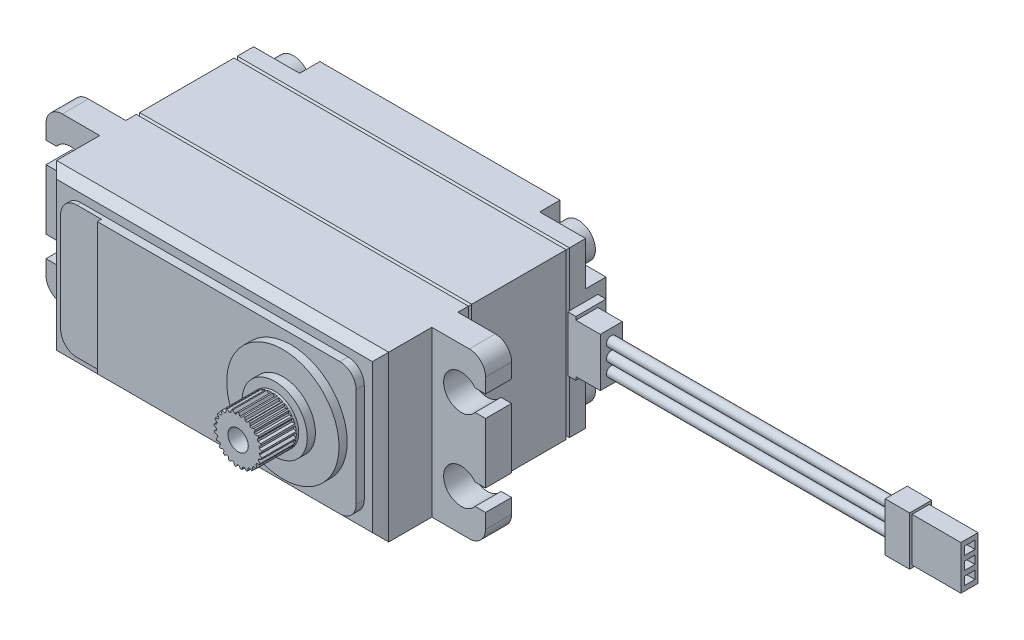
from build123d import *

# Parameters (mm, degrees)
SKETCH_1_W          = 40.8
SKETCH_1_H          = 20.2
EXTRUDE_1_DEPTH     = 4.7
CHAMFER_1_SIZE      = 0.2
SKETCH_2_W          = 40.8
SKETCH_2_H          = 20.2
EXTRUDE_2_DEPTH     = 12
CHAMFER_5_SIZE      = 0.2
SKETCH_3_W          = 40.8
SKETCH_3_H          = 20.2
EXTRUDE_3_DEPTH     = 11
CHAMFER_6_SIZE      = 0.2
CHAMFER_3_SIZE      = 1
CHAMFER_4_SIZE      = 0.2
SKETCH_4_R          = 6.9
EXTRUDE_4_DEPTH     = 2
SKETCH_5_R          = 4
EXTRUDE_5_DEPTH     = 1
SKETCH_6_R          = 2.95
EXTRUDE_6_DEPTH     = 4.5
SKETCH_7_R          = 1.25
CUT_EXTRUDE_1_DEPTH = 5
CUT_EXTRUDE_2_DEPTH = 4.2
EXTRUDE_7_DEPTH     = 3.2
FILLET_1_R          = 2
SKETCH_10_W         = 36.8
SKETCH_10_H         = 16.2
SKETCH_10_R         = 6.9
EXTRUDE_8_DEPTH     = 1
SKETCH_11_W         = 5
SKETCH_11_H         = 16.2
CUT_EXTRUDE_3_DEPTH = 0.5
FILLET_2_R          = 2
SKETCH_12_W         = 3.7
SKETCH_12_H         = 6.8
EXTRUDE_9_DEPTH     = 1
SKETCH_13_W         = 2.7
SKETCH_13_H         = 6
EXTRUDE_10_DEPTH    = 3
SKETCH_14_R         = 0.6
EXTRUDE_11_DEPTH    = 35
SKETCH_15_W         = 2.7
SKETCH_15_H         = 6
EXTRUDE_12_DEPTH    = 3
SKETCH_16_W         = 2.1
SKETCH_16_H         = 5.4
SKETCH_16_W_2       = 1.300246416
SKETCH_16_H_2       = 1
EXTRUDE_13_DEPTH    = 6
SKETCH_17_R         = 1
CUT_EXTRUDE_4_DEPTH = 2.5
SKETCH_18_R         = 1
CUT_EXTRUDE_5_DEPTH = 2.5
SKETCH_19_R         = 2.1
EXTRUDE_14_DEPTH    = 2


with BuildPart() as part:
    # Sketch 1 → Extrude 1 (new body)
    with BuildSketch(Plane.XY):
        Rectangle(SKETCH_1_W, SKETCH_1_H)
    extrude(amount=EXTRUDE_1_DEPTH)

    # Chamfer 1
    chamfer_1_edges = [part.edges().sort_by_distance(p)[0] for p in [
        (20.4, 0, 4.7),
        (0, 10.1, 4.7),
        (-20.4, 0, 4.7),
        (0, -10.1, 4.7),
    ]]
    chamfer(chamfer_1_edges, length=CHAMFER_1_SIZE)



with BuildPart() as body_2:
    # Sketch 2 → Extrude 2 (new body)
    with BuildSketch(Plane.XY.offset(4.7)):
        Rectangle(SKETCH_2_W, SKETCH_2_H)
    extrude(amount=EXTRUDE_2_DEPTH)

    # Chamfer 5
    chamfer_5_edges = [body_2.edges().sort_by_distance(p)[0] for p in [
        (0, -10.1, 16.7),
        (20.4, 0, 16.7),
        (0, 10.1, 16.7),
        (-20.4, 0, 16.7),
    ]]
    chamfer(chamfer_5_edges, length=CHAMFER_5_SIZE)

    # Chamfer 4
    chamfer_4_edges = [body_2.edges().sort_by_distance(p)[0] for p in [
        (20.4, 0, 4.7),
        (0, -10.1, 4.7),
        (-20.4, 0, 4.7),
        (0, 10.1, 4.7),
    ]]
    chamfer(chamfer_4_edges, length=CHAMFER_4_SIZE)


with BuildPart() as body_3:
    # Sketch 3 → Extrude 3 (new body)
    with BuildSketch(Plane.XY.offset(16.7)):
        Rectangle(SKETCH_3_W, SKETCH_3_H)
    extrude(amount=EXTRUDE_3_DEPTH)

    # Chamfer 6
    chamfer_6_edges = [body_3.edges().sort_by_distance(p)[0] for p in [
        (20.4, 0, 16.7),
        (0, -10.1, 16.7),
        (-20.4, 0, 16.7),
        (0, 10.1, 16.7),
    ]]
    chamfer(chamfer_6_edges, length=CHAMFER_6_SIZE)

    # Chamfer 3
    chamfer_3_edges = [body_3.edges().sort_by_distance(p)[0] for p in [
        (0, -10.1, 27.7),
        (20.4, 0, 27.7),
        (0, 10.1, 27.7),
        (-20.4, 0, 27.7),
    ]]
    chamfer(chamfer_3_edges, length=CHAMFER_3_SIZE)

    # Sketch 4 → Extrude 4 (add)
    with BuildSketch(Plane.XY.offset(27.7)):
        with Locations(Location((10.4, 0, 0), (0, 0, 180))):
            Circle(SKETCH_4_R)
    extrude(amount=EXTRUDE_4_DEPTH)

    # Sketch 5 → Extrude 5 (add)
    with BuildSketch(Plane.XY.offset(29.7)):
        with Locations((10.4, 0)):
            Circle(SKETCH_5_R)
    extrude(amount=EXTRUDE_5_DEPTH)

    # Sketch 6 → Extrude 6 (add)
    with BuildSketch(Plane.XY.offset(30.7)):
        with Locations((10.4, 0)):
            Circle(SKETCH_6_R)
    extrude(amount=EXTRUDE_6_DEPTH)

    # Sketch 7 → Cut-Extrude 1 (cut)
    with BuildSketch(Plane.XY.offset(35.2)):
        with Locations((10.4, 0)):
            Circle(SKETCH_7_R)
    extrude(amount=-CUT_EXTRUDE_1_DEPTH, mode=Mode.SUBTRACT)

    # Sketch 8 → Cut-Extrude 2 (cut)
    with BuildSketch(Plane.XY.offset(35.2)):
        with BuildLine():
            Line((11.036355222, 2.880547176), (10.812882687, 2.613339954))
            ThreePointArc((10.812882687, 2.613339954), (10.718629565, 2.62690868), (10.623963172, 2.637206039))
            Line((10.623963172, 2.637206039), (10.475180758, 2.949041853))
            ThreePointArc((10.475180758, 2.949041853), (10.757412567, 2.928268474), (11.036355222, 2.880547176))
        make_face()
        with BuildLine():
            Line((10.3, 2.948304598), (10.15, 2.633916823))
            ThreePointArc((10.15, 2.633916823), (10.055333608, 2.623619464), (9.961080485, 2.610050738))
            Line((9.961080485, 2.610050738), (9.739421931, 2.875088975))
            ThreePointArc((9.739421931, 2.875088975), (10.017953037, 2.925156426), (10.3, 2.948304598))
        make_face()
        with BuildLine():
            Line((11.732725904, 2.631794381), (11.449822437, 2.428557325))
            ThreePointArc((11.449822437, 2.428557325), (11.361904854, 2.465139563), (11.27277343, 2.498655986))
            Line((11.27277343, 2.498655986), (11.206215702, 2.837695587))
            ThreePointArc((11.206215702, 2.837695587), (11.47441455, 2.747386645), (11.732725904, 2.631794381))
        make_face()
        with BuildLine():
            Line((12.345356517, 2.217676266), (12.020797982, 2.091179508))
            ThreePointArc((12.020797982, 2.091179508), (11.944740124, 2.148476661), (11.866744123, 2.203106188))
            Line((11.866744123, 2.203106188), (11.886593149, 2.54804647))
            ThreePointArc((11.886593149, 2.54804647), (12.123907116, 2.393876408), (12.345356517, 2.217676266))
        make_face()
        with BuildLine():
            Line((12.835753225, 1.664213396), (12.489932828, 1.622405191))
            ThreePointArc((12.489932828, 1.622405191), (12.430513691, 1.696817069), (12.368553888, 1.769127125))
            Line((12.368553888, 1.769127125), (12.47356248, 2.098294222))
            ThreePointArc((12.47356248, 2.098294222), (12.665080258, 1.889950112), (12.835753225, 1.664213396))
        make_face()
        with BuildLine():
            Line((13.1731026, 1.006181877), (12.827749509, 1.051689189))
            ThreePointArc((12.827749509, 1.051689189), (12.788702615, 1.13854022), (12.746672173, 1.223987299))
            Line((12.746672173, 1.223987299), (12.930242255, 1.516698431))
            ThreePointArc((12.930242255, 1.516698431), (13.063930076, 1.2672713), (13.1731026, 1.006181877))
        make_face()
        with BuildLine():
            Line((13.33620774, 0.28492825), (13.01302176, 0.414891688))
            ThreePointArc((13.01302176, 0.414891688), (12.996800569, 0.508724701), (12.977340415, 0.601939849))
            Line((12.977340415, 0.601939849), (13.227937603, 0.8398029))
            ThreePointArc((13.227937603, 0.8398029), (13.295395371, 0.564965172), (13.33620774, 0.28492825))
        make_face()
        with BuildLine():
            Line((13.314820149, -0.454228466), (13.034108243, -0.247974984))
            ThreePointArc((13.034108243, -0.247974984), (13.041731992, -0.153055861), (13.04606488, -0.057929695))
            Line((13.04606488, -0.057929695), (13.347943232, 0.110139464))
            ThreePointArc((13.347943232, 0.110139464), (13.344932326, -0.172839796), (13.314820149, -0.454228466))
        make_face()
        with BuildLine():
            Line((13.110283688, -1.164844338), (12.889684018, -0.895260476))
            ThreePointArc((12.889684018, -0.895260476), (12.920673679, -0.805219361), (12.948527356, -0.714159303))
            Line((12.948527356, -0.714159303), (13.282718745, -0.626444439))
            ThreePointArc((13.282718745, -0.626444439), (13.209428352, -0.899784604), (13.110283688, -1.164844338))
        make_face()
        with BuildLine():
            Line((12.735450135, -1.802268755), (12.58882379, -1.486293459))
            ThreePointArc((12.58882379, -1.486293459), (12.641232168, -1.406787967), (12.690856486, -1.325515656))
            Line((12.690856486, -1.325515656), (13.036362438, -1.323666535))
            ThreePointArc((13.036362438, -1.323666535), (12.897397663, -1.570192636), (12.735450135, -1.802268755))
        make_face()
        with BuildLine():
            Line((12.213871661, -2.326449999), (12.150431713, -1.983937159))
            ThreePointArc((12.150431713, -1.983937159), (12.220965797, -1.919962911), (12.289242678, -1.853584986))
            Line((12.289242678, -1.853584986), (12.624353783, -1.937717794))
            ThreePointArc((12.624353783, -1.937717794), (12.428446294, -2.14193969), (12.213871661, -2.326449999))
        make_face()
        with BuildLine():
            Line((11.57832096, -2.704451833), (11.602053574, -2.35692279))
            ThreePointArc((11.602053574, -2.35692279), (11.686281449, -2.312499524), (11.768920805, -2.265186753))
            Line((11.768920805, -2.265186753), (12.072580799, -2.430015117))
            ThreePointArc((12.072580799, -2.430015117), (11.832040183, -2.579100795), (11.57832096, -2.704451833))
        make_face()
        with BuildLine():
            Line((10.868732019, -2.912523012), (10.978145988, -2.581814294))
            ThreePointArc((10.978145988, -2.581814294), (11.070775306, -2.559733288), (11.162584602, -2.534458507))
            Line((11.162584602, -2.534458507), (11.415713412, -2.769625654))
            ThreePointArc((11.415713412, -2.769625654), (11.145653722, -2.854207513), (10.868732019, -2.912523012))
        make_face()
        with BuildLine():
            Line((10.129690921, -2.937589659), (10.317911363, -2.644480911))
            ThreePointArc((10.317911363, -2.644480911), (10.413121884, -2.646129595), (10.508332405, -2.644480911))
            Line((10.508332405, -2.644480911), (10.695025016, -2.935210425))
            ThreePointArc((10.695025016, -2.935210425), (10.412415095, -2.949973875), (10.129690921, -2.937589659))
        make_face()
        with BuildLine():
            Line((9.407634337, -2.778076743), (9.662834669, -2.540985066))
            ThreePointArc((9.662834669, -2.540985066), (9.754643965, -2.566259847), (9.847273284, -2.588340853))
            Line((9.847273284, -2.588340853), (9.955799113, -2.91636513))
            ThreePointArc((9.955799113, -2.91636513), (9.678396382, -2.86038253), (9.407634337, -2.778076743))
        make_face()
        with BuildLine():
            Line((8.747931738, -2.444007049), (9.054076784, -2.277829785))
            ThreePointArc((9.054076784, -2.277829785), (9.13671614, -2.325142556), (9.220944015, -2.369565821))
            Line((9.220944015, -2.369565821), (9.244483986, -2.714273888))
            ThreePointArc((9.244483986, -2.714273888), (8.989718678, -2.59106283), (8.747931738, -2.444007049))
        make_face()
        with BuildLine():
            Line((8.192034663, -1.956371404), (8.529888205, -1.871550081))
            ThreePointArc((8.529888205, -1.871550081), (8.598165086, -1.937928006), (8.66869917, -2.001902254))
            Line((8.66869917, -2.001902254), (8.605774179, -2.341634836))
            ThreePointArc((8.605774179, -2.341634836), (8.389654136, -2.158937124), (8.192034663, -1.956371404))
        make_face()
        with BuildLine():
            Line((7.77487217, -1.345809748), (8.123205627, -1.347674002))
            ThreePointArc((8.123205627, -1.347674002), (8.172829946, -1.428946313), (8.225238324, -1.508451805))
            Line((8.225238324, -1.508451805), (8.07980218, -1.821862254))
            ThreePointArc((8.07980218, -1.821862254), (7.915907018, -1.591157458), (7.77487217, -1.345809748))
        make_face()
        with BuildLine():
            Line((7.522656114, -0.650685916), (7.859582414, -0.73911861))
            ThreePointArc((7.859582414, -0.73911861), (7.887436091, -0.830178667), (7.918425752, -0.920219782))
            Line((7.918425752, -0.920219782), (7.699616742, -1.187615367))
            ThreePointArc((7.699616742, -1.187615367), (7.598244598, -0.923399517), (7.522656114, -0.650685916))
        make_face()
        with BuildLine():
            Line((7.451234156, 0.085322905), (7.75558298, -0.084121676))
            ThreePointArc((7.75558298, -0.084121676), (7.759915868, -0.179247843), (7.767539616, -0.274166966))
            Line((7.767539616, -0.274166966), (7.489106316, -0.478746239))
            ThreePointArc((7.489106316, -0.478746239), (7.456626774, -0.197620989), (7.451234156, 0.085322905))
        make_face()
        with BuildLine():
            Line((7.565094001, 0.815970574), (7.817741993, 0.576160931))
            ThreePointArc((7.817741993, 0.576160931), (7.79828184, 0.482945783), (7.782060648, 0.38911277))
            Line((7.782060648, 0.38911277), (7.461498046, 0.260204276))
            ThreePointArc((7.461498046, 0.260204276), (7.499951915, 0.540574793), (7.565094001, 0.815970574))
        make_face()
        with BuildLine():
            Line((7.857081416, 1.495347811), (8.042153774, 1.200241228))
            ThreePointArc((8.042153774, 1.200241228), (8.000123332, 1.114794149), (7.961076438, 1.027943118))
            Line((7.961076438, 1.027943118), (7.61852666, 0.9828052))
            ThreePointArc((7.61852666, 0.9828052), (7.725497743, 1.244804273), (7.857081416, 1.495347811))
        make_face()
        with BuildLine():
            Line((8.308849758, 2.080766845), (8.414717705, 1.748905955))
            ThreePointArc((8.414717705, 1.748905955), (8.352757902, 1.676595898), (8.293338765, 1.602184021))
            Line((8.293338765, 1.602184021), (7.950325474, 1.643652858))
            ThreePointArc((7.950325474, 1.643652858), (8.119092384, 1.870818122), (8.308849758, 2.080766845))
        make_face()
        with BuildLine():
            Line((8.89201276, 2.535443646), (8.912024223, 2.187680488))
            ThreePointArc((8.912024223, 2.187680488), (8.834028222, 2.133050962), (8.757970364, 2.075753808))
            Line((8.757970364, 2.075753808), (8.436046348, 2.201223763))
            ThreePointArc((8.436046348, 2.201223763), (8.656004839, 2.379281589), (8.89201276, 2.535443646))
        make_face()
        with BuildLine():
            Line((9.569928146, 2.830809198), (9.502825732, 2.488995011))
            ThreePointArc((9.502825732, 2.488995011), (9.413694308, 2.455478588), (9.325776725, 2.41889635))
            Line((9.325776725, 2.41889635), (9.045169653, 2.620483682))
            ThreePointArc((9.045169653, 2.620483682), (9.302498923, 2.738246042), (9.569928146, 2.830809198))
        make_face()
    extrude(amount=-CUT_EXTRUDE_2_DEPTH, mode=Mode.SUBTRACT)

    # Sketch 9 → Extrude 7 (add)
    with BuildSketch(Plane.XY.offset(18.2)):
        with BuildLine():
            Line((20.4, -10.1), (27, -10.1))
            Line((27, -10.1), (27, -6.3))
            Line((27, -6.3), (25.712454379, -6.3))
            ThreePointArc((25.712454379, -6.3), (21.85, -5), (25.712454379, -3.7))
            Line((25.712454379, -3.7), (27, -3.7))
            Line((27, -3.7), (27, 3.7))
            Line((27, 3.7), (25.712454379, 3.7))
            ThreePointArc((25.712454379, 3.7), (21.85, 5), (25.712454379, 6.3))
            Line((25.712454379, 6.3), (27, 6.3))
            Line((27, 6.3), (27, 10.1))
            Line((27, 10.1), (20.4, 10.1))
            Line((20.4, 10.1), (20.4, -10.1))
        make_face()
        with BuildLine():
            Line((-27, 10.1), (-27, 6.3))
            Line((-27, 6.3), (-25.712454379, 6.3))
            ThreePointArc((-25.712454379, 6.3), (-21.85, 5), (-25.712454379, 3.7))
            Line((-25.712454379, 3.7), (-27, 3.7))
            Line((-27, 3.7), (-27, -3.7))
            Line((-27, -3.7), (-25.712454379, -3.7))
            ThreePointArc((-25.712454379, -3.7), (-21.85, -5), (-25.712454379, -6.3))
            Line((-25.712454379, -6.3), (-27, -6.3))
            Line((-27, -6.3), (-27, -10.1))
            Line((-27, -10.1), (-20.4, -10.1))
            Line((-20.4, -10.1), (-20.4, 10.1))
            Line((-20.4, 10.1), (-27, 10.1))
        make_face()
    extrude(amount=EXTRUDE_7_DEPTH)

    # Fillet 1
    fillet_1_edges = [body_3.edges().sort_by_distance(p)[0] for p in [
        (-27, -10.1, 19.8),
        (-27, 10.1, 19.8),
        (27, -10.1, 19.8),
        (27, 10.1, 19.8),
    ]]
    fillet(fillet_1_edges, radius=FILLET_1_R)

    # Sketch 10 → Extrude 8 (add)
    with BuildSketch(Plane.XY.offset(27.7)):
        Rectangle(SKETCH_10_W, SKETCH_10_H)
        with Locations((10.4, 0)):
            Circle(SKETCH_10_R, mode=Mode.SUBTRACT)
    extrude(amount=EXTRUDE_8_DEPTH)

    # Sketch 11 → Cut-Extrude 3 (cut)
    with BuildSketch(Plane.XY.offset(28.7)):
        with Locations((-15.9, 0)):
            Rectangle(SKETCH_11_W, SKETCH_11_H)
    extrude(amount=-CUT_EXTRUDE_3_DEPTH, mode=Mode.SUBTRACT)

    # Fillet 2
    fillet_2_edges = [body_3.edges().sort_by_distance(p)[0] for p in [
        (18.4, 8.1, 28.2),
        (18.4, -8.1, 28.2),
        (-18.4, -8.1, 27.95),
        (-18.4, 8.1, 27.95),
    ]]
    fillet(fillet_2_edges, radius=FILLET_2_R)


with BuildPart() as part_1:
    add(part.part)

    add(body_2.part)  # Extrude 9 merges body 2
    # Sketch 12 → Extrude 9 (add)
    with BuildSketch(Plane(origin=(20.4, 0, 0), x_dir=(0, 0, -1), z_dir=(1, 0, 0))):
        with Locations((-2.85, 0)):
            Rectangle(SKETCH_12_W, SKETCH_12_H)
    extrude(amount=EXTRUDE_9_DEPTH)

    # Sketch 13 → Extrude 10 (add)
    with BuildSketch(Plane(origin=(21.4, 0, 0), x_dir=(0, 0, -1), z_dir=(1, 0, 0))):
        with Locations((-3.35, 0)):
            Rectangle(SKETCH_13_W, SKETCH_13_H)
    extrude(amount=EXTRUDE_10_DEPTH)

    # Sketch 14 → Extrude 11 (add)
    with BuildSketch(Plane(origin=(24.4, 0, 0), x_dir=(0, 0, -1), z_dir=(1, 0, 0))):
        with Locations((-3.35, 1.6)):
            Circle(SKETCH_14_R)
        with Locations((-3.35, 0)):
            Circle(SKETCH_14_R)
        with Locations((-3.35, -1.6)):
            Circle(SKETCH_14_R)
    extrude(amount=EXTRUDE_11_DEPTH)

    # Sketch 15 → Extrude 12 (add)
    with BuildSketch(Plane(origin=(59.4, 0, 0), x_dir=(0, 0, -1), z_dir=(1, 0, 0))):
        with Locations((-3.35, 0)):
            Rectangle(SKETCH_15_W, SKETCH_15_H)
    extrude(amount=EXTRUDE_12_DEPTH)

    # Sketch 16 → Extrude 13 (add)
    with BuildSketch(Plane(origin=(62.4, 0, 0), x_dir=(0, 0, -1), z_dir=(1, 0, 0))):
        with Locations((-3.35, 0)):
            Rectangle(SKETCH_16_W, SKETCH_16_H)
        with Locations((-3.316419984, 1.6)):
            Rectangle(SKETCH_16_W_2, SKETCH_16_H_2, mode=Mode.SUBTRACT)
        with Locations((-3.316419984, 0)):
            Rectangle(SKETCH_16_W_2, SKETCH_16_H_2, mode=Mode.SUBTRACT)
        with Locations((-3.316419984, -1.6)):
            Rectangle(SKETCH_16_W_2, SKETCH_16_H_2, mode=Mode.SUBTRACT)
    extrude(amount=EXTRUDE_13_DEPTH)

    # Sketch 17 → Cut-Extrude 4 (cut)
    # profile 1 of 4: a face of its own
    with BuildSketch(Plane(origin=(0, 0, 0), x_dir=(-1, 0, 0), z_dir=(0, 0, -1))):
        with BuildLine():
            Line((-14.75, 7.5), (-14.75, 10.1))
            Line((-14.75, 10.1), (-20.4, 10.1))
            Line((-20.4, 10.1), (-20.4, 4.75))
            Line((-20.4, 4.75), (-17.5, 4.75))
            ThreePointArc((-17.5, 4.75), (-15.555456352, 5.555456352), (-14.75, 7.5))
        make_face()
        with Locations((-17.5, 7.5)):
            Circle(SKETCH_17_R, mode=Mode.SUBTRACT)
    # profile 2 of 4: a face of its own
    with BuildSketch(Plane(origin=(0, 0, 0), x_dir=(-1, 0, 0), z_dir=(0, 0, -1))):
        with BuildLine():
            Line((-17.5, -4.75), (-20.4, -4.75))
            Line((-20.4, -4.75), (-20.4, -10.1))
            Line((-20.4, -10.1), (-14.75, -10.1))
            Line((-14.75, -10.1), (-14.75, -7.5))
            ThreePointArc((-14.75, -7.5), (-15.555456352, -5.555456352), (-17.5, -4.75))
        make_face()
        with Locations((-17.5, -7.5)):
            Circle(SKETCH_17_R, mode=Mode.SUBTRACT)
    # profile 3 of 4: a face of its own
    with BuildSketch(Plane(origin=(0, 0, 0), x_dir=(-1, 0, 0), z_dir=(0, 0, -1))):
        with BuildLine():
            Line((17.5, -4.75), (20.4, -4.75))
            Line((20.4, -4.75), (20.4, -10.1))
            Line((20.4, -10.1), (14.75, -10.1))
            Line((14.75, -10.1), (14.75, -7.5))
            ThreePointArc((14.75, -7.5), (15.555456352, -5.555456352), (17.5, -4.75))
        make_face()
        with Locations((17.5, -7.5)):
            Circle(SKETCH_17_R, mode=Mode.SUBTRACT)
    # profile 4 of 4: a face of its own
    with BuildSketch(Plane(origin=(0, 0, 0), x_dir=(-1, 0, 0), z_dir=(0, 0, -1))):
        with BuildLine():
            Line((14.75, 7.5), (14.75, 10.1))
            Line((14.75, 10.1), (20.4, 10.1))
            Line((20.4, 10.1), (20.4, 4.75))
            Line((20.4, 4.75), (17.5, 4.75))
            ThreePointArc((17.5, 4.75), (15.555456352, 5.555456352), (14.75, 7.5))
        make_face()
        with Locations((17.5, 7.5)):
            Circle(SKETCH_17_R, mode=Mode.SUBTRACT)
    extrude(amount=-CUT_EXTRUDE_4_DEPTH, mode=Mode.SUBTRACT)

    # Sketch 18 → Cut-Extrude 5 (cut)
    with BuildSketch(Plane(origin=(0, 0, 0), x_dir=(-1, 0, 0), z_dir=(0, 0, -1))):
        with Locations((-17.5, -7.5)):
            Circle(SKETCH_18_R)
        with Locations((-17.5, 7.5)):
            Circle(SKETCH_18_R)
        with Locations((17.5, 7.5)):
            Circle(SKETCH_18_R)
        with Locations((17.5, -7.5)):
            Circle(SKETCH_18_R)
    extrude(amount=-CUT_EXTRUDE_5_DEPTH, mode=Mode.SUBTRACT)

    # Sketch 19 → Extrude 14 (add)
    # profile 1 of 4: a face of its own
    with BuildSketch(Plane(origin=(0, 0, 2.5), x_dir=(-1, 0, 0), z_dir=(0, 0, -1))):
        with Locations((-17.5, 7.5)):
            Circle(SKETCH_19_R)
        with BuildLine():
            Line((-18, 7), (-18, 5.822949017))
            ThreePointArc((-18, 5.822949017), (-17.5, 5.75), (-17, 5.822949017))
            Line((-17, 5.822949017), (-17, 7))
            Line((-17, 7), (-15.822949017, 7))
            ThreePointArc((-15.822949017, 7), (-15.75, 7.5), (-15.822949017, 8))
            Line((-15.822949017, 8), (-17, 8))
            Line((-17, 8), (-17, 9.177050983))
            ThreePointArc((-17, 9.177050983), (-17.5, 9.25), (-18, 9.177050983))
            Line((-18, 9.177050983), (-18, 8))
            Line((-18, 8), (-19.177050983, 8))
            ThreePointArc((-19.177050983, 8), (-19.25, 7.5), (-19.177050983, 7))
            Line((-19.177050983, 7), (-18, 7))
        make_face(mode=Mode.SUBTRACT)
    # profile 2 of 4: a face of its own
    with BuildSketch(Plane(origin=(0, 0, 2.5), x_dir=(-1, 0, 0), z_dir=(0, 0, -1))):
        with Locations(Location((-17.5, -7.5, 0), (0, 0, 180))):
            Circle(SKETCH_19_R)
        with BuildLine():
            Line((-17, -7), (-15.822949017, -7))
            ThreePointArc((-15.822949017, -7), (-15.75, -7.5), (-15.822949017, -8))
            Line((-15.822949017, -8), (-17, -8))
            Line((-17, -8), (-17, -9.177050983))
            ThreePointArc((-17, -9.177050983), (-17.5, -9.25), (-18, -9.177050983))
            Line((-18, -9.177050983), (-18, -8))
            Line((-18, -8), (-19.177050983, -8))
            ThreePointArc((-19.177050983, -8), (-19.25, -7.5), (-19.177050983, -7))
            Line((-19.177050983, -7), (-18, -7))
            Line((-18, -7), (-18, -5.822949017))
            ThreePointArc((-18, -5.822949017), (-17.5, -5.75), (-17, -5.822949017))
            Line((-17, -5.822949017), (-17, -7))
        make_face(mode=Mode.SUBTRACT)
    # profile 3 of 4: a face of its own
    with BuildSketch(Plane(origin=(0, 0, 2.5), x_dir=(-1, 0, 0), z_dir=(0, 0, -1))):
        with Locations(Location((17.5, 7.5, 0), (0, 0, 180))):
            Circle(SKETCH_19_R)
        with BuildLine():
            Line((17, 8), (15.822949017, 8))
            ThreePointArc((15.822949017, 8), (15.75, 7.5), (15.822949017, 7))
            Line((15.822949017, 7), (17, 7))
            Line((17, 7), (17, 5.822949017))
            ThreePointArc((17, 5.822949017), (17.5, 5.75), (18, 5.822949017))
            Line((18, 5.822949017), (18, 7))
            Line((18, 7), (19.177050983, 7))
            ThreePointArc((19.177050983, 7), (19.25, 7.5), (19.177050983, 8))
            Line((19.177050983, 8), (18, 8))
            Line((18, 8), (18, 9.177050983))
            ThreePointArc((18, 9.177050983), (17.5, 9.25), (17, 9.177050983))
            Line((17, 9.177050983), (17, 8))
        make_face(mode=Mode.SUBTRACT)
    # profile 4 of 4: a face of its own
    with BuildSketch(Plane(origin=(0, 0, 2.5), x_dir=(-1, 0, 0), z_dir=(0, 0, -1))):
        with Locations((17.5, -7.5)):
            Circle(SKETCH_19_R)
        with BuildLine():
            Line((17, -8), (15.822949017, -8))
            ThreePointArc((15.822949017, -8), (15.75, -7.5), (15.822949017, -7))
            Line((15.822949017, -7), (17, -7))
            Line((17, -7), (17, -5.822949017))
            ThreePointArc((17, -5.822949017), (17.5, -5.75), (18, -5.822949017))
            Line((18, -5.822949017), (18, -7))
            Line((18, -7), (19.177050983, -7))
            ThreePointArc((19.177050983, -7), (19.25, -7.5), (19.177050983, -8))
            Line((19.177050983, -8), (18, -8))
            Line((18, -8), (18, -9.177050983))
            ThreePointArc((18, -9.177050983), (17.5, -9.25), (17, -9.177050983))
            Line((17, -9.177050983), (17, -8))
        make_face(mode=Mode.SUBTRACT)
    extrude(amount=EXTRUDE_14_DEPTH)


solid = Compound([body_3.part, part_1.part])
